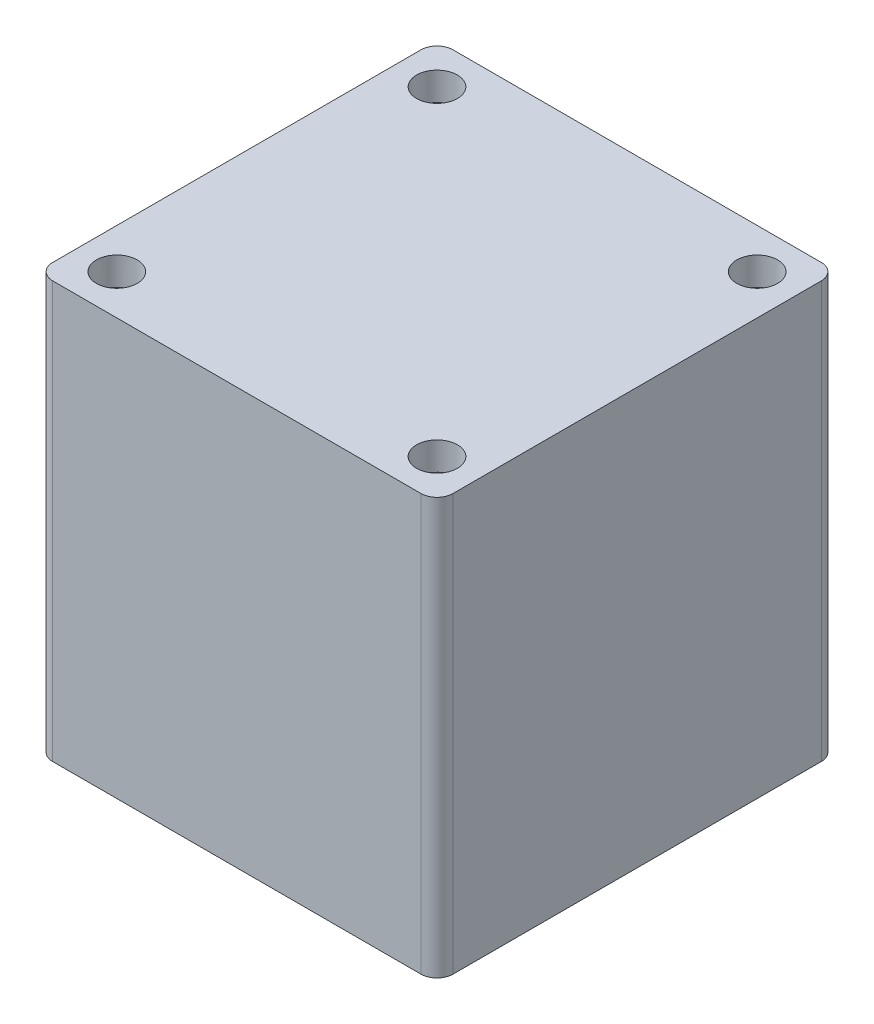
ISO-10303-21;
HEADER;
FILE_DESCRIPTION(('STEP AP214'),'2;1');
FILE_NAME('part.step','',(''),(''),'','','');
FILE_SCHEMA(('AUTOMOTIVE_DESIGN { 1 0 10303 214 1 1 1 1 }'));
ENDSEC;
DATA;
#1=APPLICATION_CONTEXT('core data for automotive mechanical design processes');
#2=APPLICATION_PROTOCOL_DEFINITION('international standard','automotive_design',2000,#1);
#3=PRODUCT_CONTEXT('',#1,'mechanical');
#4=PRODUCT('Part','Part','',(#3));
#5=PRODUCT_RELATED_PRODUCT_CATEGORY('part','',(#4));
#6=PRODUCT_DEFINITION_FORMATION('','',#4);
#7=PRODUCT_DEFINITION_CONTEXT('part definition',#1,'design');
#8=PRODUCT_DEFINITION('design','',#6,#7);
#9=PRODUCT_DEFINITION_SHAPE('','',#8);
#10=(LENGTH_UNIT() NAMED_UNIT(*) SI_UNIT(.MILLI.,.METRE.));
#11=(NAMED_UNIT(*) PLANE_ANGLE_UNIT() SI_UNIT($,.RADIAN.));
#12=(NAMED_UNIT(*) SI_UNIT($,.STERADIAN.) SOLID_ANGLE_UNIT());
#13=UNCERTAINTY_MEASURE_WITH_UNIT(LENGTH_MEASURE(1.E-05),#10,'distance_accuracy_value','');
#14=(GEOMETRIC_REPRESENTATION_CONTEXT(3) GLOBAL_UNCERTAINTY_ASSIGNED_CONTEXT((#13)) GLOBAL_UNIT_ASSIGNED_CONTEXT((#10,
#11,#12)) REPRESENTATION_CONTEXT('',''));
#15=CARTESIAN_POINT('',(0.,0.,0.));
#16=DIRECTION('',(0.,0.,1.));
#17=DIRECTION('',(1.,0.,0.));
#18=AXIS2_PLACEMENT_3D('',#15,#16,#17);
#19=CARTESIAN_POINT('',(0.,0.,0.));
#20=DIRECTION('',(0.,1.,0.));
#21=DIRECTION('',(0.,0.,1.));
#22=AXIS2_PLACEMENT_3D('',#19,#20,#21);
#23=PLANE('',#22);
#24=DIRECTION('',(0.707106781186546,0.,-0.707106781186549));
#25=VECTOR('',#24,1.);
#26=CARTESIAN_POINT('',(-8.62867965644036,0.,-8.62867965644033));
#27=LINE('',#26,#25);
#28=CARTESIAN_POINT('',(-10.1066017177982,0.,-7.1507575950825));
#29=VERTEX_POINT('',#28);
#30=CARTESIAN_POINT('',(4.74264068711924,0.,-22.));
#31=VERTEX_POINT('',#30);
#32=EDGE_CURVE('E486',#29,#31,#27,.T.);
#33=ORIENTED_EDGE('',*,*,#32,.T.);
#34=DIRECTION('',(0.70710678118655,0.,0.707106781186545));
#35=VECTOR('',#34,1.);
#36=CARTESIAN_POINT('',(13.3713203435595,0.,-13.3713203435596));
#37=LINE('',#36,#35);
#38=CARTESIAN_POINT('',(22.,0.,-4.74264068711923));
#39=VERTEX_POINT('',#38);
#40=EDGE_CURVE('E397',#31,#39,#37,.T.);
#41=ORIENTED_EDGE('',*,*,#40,.T.);
#42=DIRECTION('',(-0.707106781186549,0.,0.707106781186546));
#43=VECTOR('',#42,1.);
#44=CARTESIAN_POINT('',(8.62867965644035,0.,8.62867965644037));
#45=LINE('',#44,#43);
#46=CARTESIAN_POINT('',(-4.74264068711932,0.,22.));
#47=VERTEX_POINT('',#46);
#48=EDGE_CURVE('E417',#39,#47,#45,.T.);
#49=ORIENTED_EDGE('',*,*,#48,.T.);
#50=DIRECTION('',(1.,0.,0.));
#51=VECTOR('',#50,1.);
#52=CARTESIAN_POINT('',(22.,0.,22.));
#53=LINE('',#52,#51);
#54=CARTESIAN_POINT('',(-20.7573593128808,0.,22.));
#55=VERTEX_POINT('',#54);
#56=EDGE_CURVE('E557',#55,#47,#53,.T.);
#57=ORIENTED_EDGE('',*,*,#56,.F.);
#58=DIRECTION('',(-0.707106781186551,0.,0.707106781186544));
#59=VECTOR('',#58,1.);
#60=CARTESIAN_POINT('',(0.621320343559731,0.,0.621320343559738));
#61=LINE('',#60,#59);
#62=CARTESIAN_POINT('',(5.40559159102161,0.,-4.16295090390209));
#63=VERTEX_POINT('',#62);
#64=EDGE_CURVE('E453',#63,#55,#61,.T.);
#65=ORIENTED_EDGE('',*,*,#64,.F.);
#66=DIRECTION('',(0.707106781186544,0.,0.707106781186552));
#67=VECTOR('',#66,1.);
#68=CARTESIAN_POINT('',(4.78427124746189,0.,-4.78427124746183));
#69=LINE('',#68,#67);
#70=CARTESIAN_POINT('',(3.28427124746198,0.,-6.28427124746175));
#71=VERTEX_POINT('',#70);
#72=EDGE_CURVE('E457',#71,#63,#69,.T.);
#73=ORIENTED_EDGE('',*,*,#72,.F.);
#74=DIRECTION('',(0.707106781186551,0.,-0.707106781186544));
#75=VECTOR('',#74,1.);
#76=CARTESIAN_POINT('',(-1.4999999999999,0.,-1.49999999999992));
#77=LINE('',#76,#75);
#78=CARTESIAN_POINT('',(-25.0000000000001,0.,22.));
#79=VERTEX_POINT('',#78);
#80=EDGE_CURVE('E447',#79,#71,#77,.T.);
#81=ORIENTED_EDGE('',*,*,#80,.F.);
#82=DIRECTION('',(0.,0.,-1.));
#83=VECTOR('',#82,1.);
#84=CARTESIAN_POINT('',(-25.,0.,0.));
#85=LINE('',#84,#83);
#86=CARTESIAN_POINT('',(-25.,0.,-7.15075759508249));
#87=VERTEX_POINT('',#86);
#88=EDGE_CURVE('E586',#79,#87,#85,.T.);
#89=ORIENTED_EDGE('',*,*,#88,.T.);
#90=DIRECTION('',(-1.,0.,0.));
#91=VECTOR('',#90,1.);
#92=CARTESIAN_POINT('',(0.,0.,-7.1507575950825));
#93=LINE('',#92,#91);
#94=EDGE_CURVE('E480',#29,#87,#93,.T.);
#95=ORIENTED_EDGE('',*,*,#94,.F.);
#96=EDGE_LOOP('',(#33,#41,#49,#57,#65,#73,#81,#89,#95));
#97=FACE_BOUND('',#96,.T.);
#98=ADVANCED_FACE('F162',(#97),#23,.F.);
#99=CARTESIAN_POINT('',(22.,-42.,22.));
#100=DIRECTION('',(0.,0.,1.));
#101=DIRECTION('',(1.,0.,0.));
#102=AXIS2_PLACEMENT_3D('',#99,#100,#101);
#103=PLANE('',#102);
#104=ORIENTED_EDGE('',*,*,#56,.T.);
#105=DIRECTION('',(0.,1.,0.));
#106=VECTOR('',#105,1.);
#107=CARTESIAN_POINT('',(-4.74264068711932,-83.5270995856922,22.));
#108=LINE('',#107,#106);
#109=CARTESIAN_POINT('',(-4.74264068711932,-42.,22.));
#110=VERTEX_POINT('',#109);
#111=EDGE_CURVE('E431',#110,#47,#108,.T.);
#112=ORIENTED_EDGE('',*,*,#111,.F.);
#113=DIRECTION('',(1.,0.,0.));
#114=VECTOR('',#113,1.);
#115=CARTESIAN_POINT('',(-22.,-42.,22.));
#116=LINE('',#115,#114);
#117=CARTESIAN_POINT('',(-20.7573593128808,-42.,22.));
#118=VERTEX_POINT('',#117);
#119=EDGE_CURVE('E541',#118,#110,#116,.T.);
#120=ORIENTED_EDGE('',*,*,#119,.F.);
#121=DIRECTION('',(0.,1.,0.));
#122=VECTOR('',#121,1.);
#123=CARTESIAN_POINT('',(-20.7573593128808,-83.5270995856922,22.));
#124=LINE('',#123,#122);
#125=EDGE_CURVE('E452',#118,#55,#124,.T.);
#126=ORIENTED_EDGE('',*,*,#125,.T.);
#127=EDGE_LOOP('',(#104,#112,#120,#126));
#128=FACE_BOUND('',#127,.T.);
#129=ADVANCED_FACE('F680',(#128),#103,.F.);
#130=CARTESIAN_POINT('',(-20.,8.,20.));
#131=DIRECTION('',(0.,-1.,0.));
#132=DIRECTION('',(0.,0.,-1.));
#133=AXIS2_PLACEMENT_3D('',#130,#131,#132);
#134=CYLINDRICAL_SURFACE('',#133,2.55);
#135=CARTESIAN_POINT('',(-20.,8.,20.));
#136=DIRECTION('',(0.,1.,0.));
#137=DIRECTION('',(0.,0.,1.));
#138=AXIS2_PLACEMENT_3D('',#135,#136,#137);
#139=CIRCLE('',#138,2.55);
#140=CARTESIAN_POINT('',(-20.,8.,22.55));
#141=VERTEX_POINT('',#140);
#142=EDGE_CURVE('E594',#141,#141,#139,.T.);
#143=ORIENTED_EDGE('',*,*,#142,.T.);
#144=EDGE_LOOP('',(#143));
#145=FACE_BOUND('',#144,.T.);
#146=CARTESIAN_POINT('',(-20.,4.5,20.));
#147=DIRECTION('',(0.,-1.,0.));
#148=DIRECTION('',(0.,0.,-1.));
#149=AXIS2_PLACEMENT_3D('',#146,#147,#148);
#150=CIRCLE('',#149,2.55);
#151=CARTESIAN_POINT('',(-20.,4.5,17.45));
#152=VERTEX_POINT('',#151);
#153=EDGE_CURVE('E166',#152,#152,#150,.T.);
#154=ORIENTED_EDGE('',*,*,#153,.T.);
#155=EDGE_LOOP('',(#154));
#156=FACE_BOUND('',#155,.T.);
#157=ADVANCED_FACE('F661',(#145,#156),#134,.F.);
#158=CARTESIAN_POINT('',(-19.9999999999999,8.,-20.0000000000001));
#159=DIRECTION('',(0.,-1.,0.));
#160=DIRECTION('',(0.,0.,-1.));
#161=AXIS2_PLACEMENT_3D('',#158,#159,#160);
#162=CYLINDRICAL_SURFACE('',#161,2.55);
#163=CARTESIAN_POINT('',(-19.9999999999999,8.,-20.0000000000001));
#164=DIRECTION('',(0.,1.,0.));
#165=DIRECTION('',(0.,0.,1.));
#166=AXIS2_PLACEMENT_3D('',#163,#164,#165);
#167=CIRCLE('',#166,2.55);
#168=CARTESIAN_POINT('',(-19.9999999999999,8.,-17.4500000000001));
#169=VERTEX_POINT('',#168);
#170=EDGE_CURVE('E590',#169,#169,#167,.T.);
#171=ORIENTED_EDGE('',*,*,#170,.T.);
#172=EDGE_LOOP('',(#171));
#173=FACE_BOUND('',#172,.T.);
#174=CARTESIAN_POINT('',(-19.9999999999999,4.5,-20.0000000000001));
#175=DIRECTION('',(0.,-1.,0.));
#176=DIRECTION('',(0.,0.,-1.));
#177=AXIS2_PLACEMENT_3D('',#174,#175,#176);
#178=CIRCLE('',#177,2.55);
#179=CARTESIAN_POINT('',(-19.9999999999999,4.5,-22.5500000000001));
#180=VERTEX_POINT('',#179);
#181=EDGE_CURVE('E652',#180,#180,#178,.T.);
#182=ORIENTED_EDGE('',*,*,#181,.T.);
#183=EDGE_LOOP('',(#182));
#184=FACE_BOUND('',#183,.T.);
#185=ADVANCED_FACE('F817',(#173,#184),#162,.F.);
#186=CARTESIAN_POINT('',(20.0000000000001,8.,-19.9999999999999));
#187=DIRECTION('',(0.,-1.,0.));
#188=DIRECTION('',(0.,0.,-1.));
#189=AXIS2_PLACEMENT_3D('',#186,#187,#188);
#190=CYLINDRICAL_SURFACE('',#189,2.55);
#191=CARTESIAN_POINT('',(20.0000000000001,8.,-19.9999999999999));
#192=DIRECTION('',(0.,1.,0.));
#193=DIRECTION('',(0.,0.,1.));
#194=AXIS2_PLACEMENT_3D('',#191,#192,#193);
#195=CIRCLE('',#194,2.55);
#196=CARTESIAN_POINT('',(20.0000000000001,8.,-17.4499999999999));
#197=VERTEX_POINT('',#196);
#198=EDGE_CURVE('E585',#197,#197,#195,.T.);
#199=ORIENTED_EDGE('',*,*,#198,.T.);
#200=EDGE_LOOP('',(#199));
#201=FACE_BOUND('',#200,.T.);
#202=CARTESIAN_POINT('',(20.0000000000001,4.5,-19.9999999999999));
#203=DIRECTION('',(0.,-1.,0.));
#204=DIRECTION('',(0.,0.,-1.));
#205=AXIS2_PLACEMENT_3D('',#202,#203,#204);
#206=CIRCLE('',#205,2.55);
#207=CARTESIAN_POINT('',(20.0000000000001,4.5,-22.5499999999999));
#208=VERTEX_POINT('',#207);
#209=EDGE_CURVE('E649',#208,#208,#206,.T.);
#210=ORIENTED_EDGE('',*,*,#209,.T.);
#211=EDGE_LOOP('',(#210));
#212=FACE_BOUND('',#211,.T.);
#213=ADVANCED_FACE('F815',(#201,#212),#190,.F.);
#214=CARTESIAN_POINT('',(19.9999999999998,8.,20.0000000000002));
#215=DIRECTION('',(0.,-1.,0.));
#216=DIRECTION('',(0.,0.,-1.));
#217=AXIS2_PLACEMENT_3D('',#214,#215,#216);
#218=CYLINDRICAL_SURFACE('',#217,2.55);
#219=CARTESIAN_POINT('',(19.9999999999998,8.,20.0000000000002));
#220=DIRECTION('',(0.,1.,0.));
#221=DIRECTION('',(0.,0.,1.));
#222=AXIS2_PLACEMENT_3D('',#219,#220,#221);
#223=CIRCLE('',#222,2.55);
#224=CARTESIAN_POINT('',(19.9999999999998,8.,22.5500000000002));
#225=VERTEX_POINT('',#224);
#226=EDGE_CURVE('E581',#225,#225,#223,.T.);
#227=ORIENTED_EDGE('',*,*,#226,.T.);
#228=EDGE_LOOP('',(#227));
#229=FACE_BOUND('',#228,.T.);
#230=CARTESIAN_POINT('',(19.9999999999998,4.5,20.0000000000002));
#231=DIRECTION('',(0.,-1.,0.));
#232=DIRECTION('',(0.,0.,-1.));
#233=AXIS2_PLACEMENT_3D('',#230,#231,#232);
#234=CIRCLE('',#233,2.55);
#235=CARTESIAN_POINT('',(19.9999999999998,4.5,17.4500000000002));
#236=VERTEX_POINT('',#235);
#237=EDGE_CURVE('E580',#236,#236,#234,.T.);
#238=ORIENTED_EDGE('',*,*,#237,.T.);
#239=EDGE_LOOP('',(#238));
#240=FACE_BOUND('',#239,.T.);
#241=ADVANCED_FACE('F164',(#229,#240),#218,.F.);
#242=CARTESIAN_POINT('',(0.,8.,-25.));
#243=DIRECTION('',(0.,0.,1.));
#244=DIRECTION('',(1.,0.,0.));
#245=AXIS2_PLACEMENT_3D('',#242,#243,#244);
#246=PLANE('',#245);
#247=DIRECTION('',(0.,-1.,0.));
#248=VECTOR('',#247,1.);
#249=CARTESIAN_POINT('',(23.,8.,-25.));
#250=LINE('',#249,#248);
#251=CARTESIAN_POINT('',(23.,8.,-25.));
#252=VERTEX_POINT('',#251);
#253=CARTESIAN_POINT('',(23.,-44.,-25.));
#254=VERTEX_POINT('',#253);
#255=EDGE_CURVE('E358',#252,#254,#250,.T.);
#256=ORIENTED_EDGE('',*,*,#255,.T.);
#257=DIRECTION('',(1.,0.,0.));
#258=VECTOR('',#257,1.);
#259=CARTESIAN_POINT('',(-23.,-44.,-25.));
#260=LINE('',#259,#258);
#261=CARTESIAN_POINT('',(-23.,-44.,-25.));
#262=VERTEX_POINT('',#261);
#263=EDGE_CURVE('E355',#262,#254,#260,.T.);
#264=ORIENTED_EDGE('',*,*,#263,.F.);
#265=DIRECTION('',(0.,-1.,0.));
#266=VECTOR('',#265,1.);
#267=CARTESIAN_POINT('',(-23.,8.,-25.));
#268=LINE('',#267,#266);
#269=CARTESIAN_POINT('',(-23.,8.,-25.));
#270=VERTEX_POINT('',#269);
#271=EDGE_CURVE('E12',#270,#262,#268,.T.);
#272=ORIENTED_EDGE('',*,*,#271,.F.);
#273=DIRECTION('',(-1.,0.,0.));
#274=VECTOR('',#273,1.);
#275=CARTESIAN_POINT('',(0.,8.,-25.));
#276=LINE('',#275,#274);
#277=EDGE_CURVE('E598',#252,#270,#276,.T.);
#278=ORIENTED_EDGE('',*,*,#277,.F.);
#279=EDGE_LOOP('',(#256,#264,#272,#278));
#280=FACE_BOUND('',#279,.T.);
#281=ADVANCED_FACE('F356',(#280),#246,.F.);
#282=CARTESIAN_POINT('',(-23.,8.,-23.));
#283=DIRECTION('',(0.,-1.,0.));
#284=DIRECTION('',(0.,0.,-1.));
#285=AXIS2_PLACEMENT_3D('',#282,#283,#284);
#286=CYLINDRICAL_SURFACE('',#285,2.);
#287=ORIENTED_EDGE('',*,*,#271,.T.);
#288=CARTESIAN_POINT('',(-23.,-44.,-23.));
#289=DIRECTION('',(0.,-1.,0.));
#290=DIRECTION('',(0.,0.,-1.));
#291=AXIS2_PLACEMENT_3D('',#288,#289,#290);
#292=CIRCLE('',#291,2.);
#293=CARTESIAN_POINT('',(-25.,-44.,-23.));
#294=VERTEX_POINT('',#293);
#295=EDGE_CURVE('E349',#294,#262,#292,.T.);
#296=ORIENTED_EDGE('',*,*,#295,.F.);
#297=DIRECTION('',(0.,-1.,0.));
#298=VECTOR('',#297,1.);
#299=CARTESIAN_POINT('',(-25.,8.,-23.));
#300=LINE('',#299,#298);
#301=CARTESIAN_POINT('',(-25.,8.,-23.));
#302=VERTEX_POINT('',#301);
#303=EDGE_CURVE('E173',#302,#294,#300,.T.);
#304=ORIENTED_EDGE('',*,*,#303,.F.);
#305=CARTESIAN_POINT('',(-23.,8.,-23.));
#306=DIRECTION('',(0.,1.,0.));
#307=DIRECTION('',(0.,0.,1.));
#308=AXIS2_PLACEMENT_3D('',#305,#306,#307);
#309=CIRCLE('',#308,2.);
#310=EDGE_CURVE('E350',#270,#302,#309,.T.);
#311=ORIENTED_EDGE('',*,*,#310,.F.);
#312=EDGE_LOOP('',(#287,#296,#304,#311));
#313=FACE_BOUND('',#312,.T.);
#314=ADVANCED_FACE('F346',(#313),#286,.T.);
#315=CARTESIAN_POINT('',(-25.,8.,0.));
#316=DIRECTION('',(-1.,0.,0.));
#317=DIRECTION('',(0.,0.,1.));
#318=AXIS2_PLACEMENT_3D('',#315,#316,#317);
#319=PLANE('',#318);
#320=ORIENTED_EDGE('',*,*,#303,.T.);
#321=DIRECTION('',(0.,0.,-1.));
#322=VECTOR('',#321,1.);
#323=CARTESIAN_POINT('',(-25.,-44.,23.));
#324=LINE('',#323,#322);
#325=CARTESIAN_POINT('',(-25.,-44.,23.));
#326=VERTEX_POINT('',#325);
#327=EDGE_CURVE('E369',#326,#294,#324,.T.);
#328=ORIENTED_EDGE('',*,*,#327,.F.);
#329=DIRECTION('',(0.,-1.,0.));
#330=VECTOR('',#329,1.);
#331=CARTESIAN_POINT('',(-25.,8.,23.));
#332=LINE('',#331,#330);
#333=CARTESIAN_POINT('',(-25.,8.,23.));
#334=VERTEX_POINT('',#333);
#335=EDGE_CURVE('E641',#334,#326,#332,.T.);
#336=ORIENTED_EDGE('',*,*,#335,.F.);
#337=DIRECTION('',(0.,0.,-1.));
#338=VECTOR('',#337,1.);
#339=CARTESIAN_POINT('',(-25.,8.,0.));
#340=LINE('',#339,#338);
#341=EDGE_CURVE('E603',#334,#302,#340,.T.);
#342=ORIENTED_EDGE('',*,*,#341,.T.);
#343=EDGE_LOOP('',(#320,#328,#336,#342));
#344=FACE_BOUND('',#343,.T.);
#345=ORIENTED_EDGE('',*,*,#88,.F.);
#346=DIRECTION('',(0.,1.,0.));
#347=VECTOR('',#346,1.);
#348=CARTESIAN_POINT('',(-25.,-42.,22.));
#349=LINE('',#348,#347);
#350=CARTESIAN_POINT('',(-25.0000000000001,-42.,22.));
#351=VERTEX_POINT('',#350);
#352=EDGE_CURVE('E577',#351,#79,#349,.T.);
#353=ORIENTED_EDGE('',*,*,#352,.F.);
#354=DIRECTION('',(0.,0.,-1.));
#355=VECTOR('',#354,1.);
#356=CARTESIAN_POINT('',(-25.,-42.,23.));
#357=LINE('',#356,#355);
#358=CARTESIAN_POINT('',(-25.,-42.,-7.15075759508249));
#359=VERTEX_POINT('',#358);
#360=EDGE_CURVE('E371',#351,#359,#357,.T.);
#361=ORIENTED_EDGE('',*,*,#360,.T.);
#362=DIRECTION('',(0.,1.,0.));
#363=VECTOR('',#362,1.);
#364=CARTESIAN_POINT('',(-25.,-83.5270995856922,-7.15075759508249));
#365=LINE('',#364,#363);
#366=EDGE_CURVE('E484',#359,#87,#365,.T.);
#367=ORIENTED_EDGE('',*,*,#366,.T.);
#368=EDGE_LOOP('',(#345,#353,#361,#367));
#369=FACE_BOUND('',#368,.T.);
#370=ADVANCED_FACE('F757',(#344,#369),#319,.T.);
#371=CARTESIAN_POINT('',(-23.,8.,23.));
#372=DIRECTION('',(0.,-1.,0.));
#373=DIRECTION('',(0.,0.,-1.));
#374=AXIS2_PLACEMENT_3D('',#371,#372,#373);
#375=CYLINDRICAL_SURFACE('',#374,2.);
#376=ORIENTED_EDGE('',*,*,#335,.T.);
#377=CARTESIAN_POINT('',(-23.,-44.,23.));
#378=DIRECTION('',(0.,-1.,0.));
#379=DIRECTION('',(0.,0.,-1.));
#380=AXIS2_PLACEMENT_3D('',#377,#378,#379);
#381=CIRCLE('',#380,2.);
#382=CARTESIAN_POINT('',(-23.,-44.,25.));
#383=VERTEX_POINT('',#382);
#384=EDGE_CURVE('E391',#383,#326,#381,.T.);
#385=ORIENTED_EDGE('',*,*,#384,.F.);
#386=DIRECTION('',(0.,-1.,0.));
#387=VECTOR('',#386,1.);
#388=CARTESIAN_POINT('',(-23.,8.,25.));
#389=LINE('',#388,#387);
#390=CARTESIAN_POINT('',(-23.,8.,25.));
#391=VERTEX_POINT('',#390);
#392=EDGE_CURVE('E638',#391,#383,#389,.T.);
#393=ORIENTED_EDGE('',*,*,#392,.F.);
#394=CARTESIAN_POINT('',(-23.,8.,23.));
#395=DIRECTION('',(0.,1.,0.));
#396=DIRECTION('',(0.,0.,1.));
#397=AXIS2_PLACEMENT_3D('',#394,#395,#396);
#398=CIRCLE('',#397,2.);
#399=EDGE_CURVE('E607',#391,#334,#398,.F.);
#400=ORIENTED_EDGE('',*,*,#399,.T.);
#401=EDGE_LOOP('',(#376,#385,#393,#400));
#402=FACE_BOUND('',#401,.T.);
#403=ADVANCED_FACE('F836',(#402),#375,.T.);
#404=CARTESIAN_POINT('',(0.,8.,25.));
#405=DIRECTION('',(0.,0.,1.));
#406=DIRECTION('',(1.,0.,0.));
#407=AXIS2_PLACEMENT_3D('',#404,#405,#406);
#408=PLANE('',#407);
#409=ORIENTED_EDGE('',*,*,#392,.T.);
#410=DIRECTION('',(-1.,0.,0.));
#411=VECTOR('',#410,1.);
#412=CARTESIAN_POINT('',(23.,-44.,25.));
#413=LINE('',#412,#411);
#414=CARTESIAN_POINT('',(23.,-44.,25.));
#415=VERTEX_POINT('',#414);
#416=EDGE_CURVE('E387',#415,#383,#413,.T.);
#417=ORIENTED_EDGE('',*,*,#416,.F.);
#418=DIRECTION('',(0.,-1.,0.));
#419=VECTOR('',#418,1.);
#420=CARTESIAN_POINT('',(23.,8.,25.));
#421=LINE('',#420,#419);
#422=CARTESIAN_POINT('',(23.,8.,25.));
#423=VERTEX_POINT('',#422);
#424=EDGE_CURVE('E635',#423,#415,#421,.T.);
#425=ORIENTED_EDGE('',*,*,#424,.F.);
#426=DIRECTION('',(-1.,0.,0.));
#427=VECTOR('',#426,1.);
#428=CARTESIAN_POINT('',(0.,8.,25.));
#429=LINE('',#428,#427);
#430=EDGE_CURVE('E611',#423,#391,#429,.T.);
#431=ORIENTED_EDGE('',*,*,#430,.T.);
#432=EDGE_LOOP('',(#409,#417,#425,#431));
#433=FACE_BOUND('',#432,.T.);
#434=ADVANCED_FACE('F840',(#433),#408,.T.);
#435=CARTESIAN_POINT('',(23.,8.,23.));
#436=DIRECTION('',(0.,-1.,0.));
#437=DIRECTION('',(0.,0.,-1.));
#438=AXIS2_PLACEMENT_3D('',#435,#436,#437);
#439=CYLINDRICAL_SURFACE('',#438,2.);
#440=ORIENTED_EDGE('',*,*,#424,.T.);
#441=CARTESIAN_POINT('',(23.,-44.,23.));
#442=DIRECTION('',(0.,-1.,0.));
#443=DIRECTION('',(0.,0.,-1.));
#444=AXIS2_PLACEMENT_3D('',#441,#442,#443);
#445=CIRCLE('',#444,2.);
#446=CARTESIAN_POINT('',(25.,-44.,23.));
#447=VERTEX_POINT('',#446);
#448=EDGE_CURVE('E383',#447,#415,#445,.T.);
#449=ORIENTED_EDGE('',*,*,#448,.F.);
#450=DIRECTION('',(0.,-1.,0.));
#451=VECTOR('',#450,1.);
#452=CARTESIAN_POINT('',(25.,8.,23.));
#453=LINE('',#452,#451);
#454=CARTESIAN_POINT('',(25.,8.,23.));
#455=VERTEX_POINT('',#454);
#456=EDGE_CURVE('E632',#455,#447,#453,.T.);
#457=ORIENTED_EDGE('',*,*,#456,.F.);
#458=CARTESIAN_POINT('',(23.,8.,23.));
#459=DIRECTION('',(0.,1.,0.));
#460=DIRECTION('',(0.,0.,1.));
#461=AXIS2_PLACEMENT_3D('',#458,#459,#460);
#462=CIRCLE('',#461,2.);
#463=EDGE_CURVE('E615',#423,#455,#462,.T.);
#464=ORIENTED_EDGE('',*,*,#463,.F.);
#465=EDGE_LOOP('',(#440,#449,#457,#464));
#466=FACE_BOUND('',#465,.T.);
#467=ADVANCED_FACE('F844',(#466),#439,.T.);
#468=CARTESIAN_POINT('',(25.,8.,0.));
#469=DIRECTION('',(-1.,0.,0.));
#470=DIRECTION('',(0.,0.,1.));
#471=AXIS2_PLACEMENT_3D('',#468,#469,#470);
#472=PLANE('',#471);
#473=ORIENTED_EDGE('',*,*,#456,.T.);
#474=DIRECTION('',(0.,0.,1.));
#475=VECTOR('',#474,1.);
#476=CARTESIAN_POINT('',(25.,-44.,-23.));
#477=LINE('',#476,#475);
#478=CARTESIAN_POINT('',(25.,-44.,-23.));
#479=VERTEX_POINT('',#478);
#480=EDGE_CURVE('E379',#479,#447,#477,.T.);
#481=ORIENTED_EDGE('',*,*,#480,.F.);
#482=DIRECTION('',(0.,-1.,0.));
#483=VECTOR('',#482,1.);
#484=CARTESIAN_POINT('',(25.,8.,-23.));
#485=LINE('',#484,#483);
#486=CARTESIAN_POINT('',(25.,8.,-23.));
#487=VERTEX_POINT('',#486);
#488=EDGE_CURVE('E629',#487,#479,#485,.T.);
#489=ORIENTED_EDGE('',*,*,#488,.F.);
#490=DIRECTION('',(0.,0.,-1.));
#491=VECTOR('',#490,1.);
#492=CARTESIAN_POINT('',(25.,8.,0.));
#493=LINE('',#492,#491);
#494=EDGE_CURVE('E618',#455,#487,#493,.T.);
#495=ORIENTED_EDGE('',*,*,#494,.F.);
#496=EDGE_LOOP('',(#473,#481,#489,#495));
#497=FACE_BOUND('',#496,.T.);
#498=ADVANCED_FACE('F848',(#497),#472,.F.);
#499=CARTESIAN_POINT('',(23.,8.,-23.));
#500=DIRECTION('',(0.,-1.,0.));
#501=DIRECTION('',(0.,0.,-1.));
#502=AXIS2_PLACEMENT_3D('',#499,#500,#501);
#503=CYLINDRICAL_SURFACE('',#502,2.);
#504=ORIENTED_EDGE('',*,*,#488,.T.);
#505=CARTESIAN_POINT('',(23.,-44.,-23.));
#506=DIRECTION('',(0.,-1.,0.));
#507=DIRECTION('',(0.,0.,-1.));
#508=AXIS2_PLACEMENT_3D('',#505,#506,#507);
#509=CIRCLE('',#508,2.);
#510=EDGE_CURVE('E363',#254,#479,#509,.T.);
#511=ORIENTED_EDGE('',*,*,#510,.F.);
#512=ORIENTED_EDGE('',*,*,#255,.F.);
#513=CARTESIAN_POINT('',(23.,8.,-23.));
#514=DIRECTION('',(0.,1.,0.));
#515=DIRECTION('',(0.,0.,1.));
#516=AXIS2_PLACEMENT_3D('',#513,#514,#515);
#517=CIRCLE('',#516,2.);
#518=EDGE_CURVE('E621',#487,#252,#517,.T.);
#519=ORIENTED_EDGE('',*,*,#518,.F.);
#520=EDGE_LOOP('',(#504,#511,#512,#519));
#521=FACE_BOUND('',#520,.T.);
#522=ADVANCED_FACE('F851',(#521),#503,.T.);
#523=CARTESIAN_POINT('',(0.,8.,0.));
#524=DIRECTION('',(0.,1.,0.));
#525=DIRECTION('',(0.,0.,1.));
#526=AXIS2_PLACEMENT_3D('',#523,#524,#525);
#527=PLANE('',#526);
#528=ORIENTED_EDGE('',*,*,#226,.F.);
#529=EDGE_LOOP('',(#528));
#530=FACE_BOUND('',#529,.T.);
#531=ORIENTED_EDGE('',*,*,#198,.F.);
#532=EDGE_LOOP('',(#531));
#533=FACE_BOUND('',#532,.T.);
#534=ORIENTED_EDGE('',*,*,#170,.F.);
#535=EDGE_LOOP('',(#534));
#536=FACE_BOUND('',#535,.T.);
#537=ORIENTED_EDGE('',*,*,#142,.F.);
#538=EDGE_LOOP('',(#537));
#539=FACE_BOUND('',#538,.T.);
#540=ORIENTED_EDGE('',*,*,#277,.T.);
#541=ORIENTED_EDGE('',*,*,#310,.T.);
#542=ORIENTED_EDGE('',*,*,#341,.F.);
#543=ORIENTED_EDGE('',*,*,#399,.F.);
#544=ORIENTED_EDGE('',*,*,#430,.F.);
#545=ORIENTED_EDGE('',*,*,#463,.T.);
#546=ORIENTED_EDGE('',*,*,#494,.T.);
#547=ORIENTED_EDGE('',*,*,#518,.T.);
#548=EDGE_LOOP('',(#540,#541,#542,#543,#544,#545,#546,#547));
#549=FACE_BOUND('',#548,.T.);
#550=ADVANCED_FACE('F807',(#530,#533,#536,#539,#549),#527,.T.);
#551=CARTESIAN_POINT('',(19.9999999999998,4.5,20.0000000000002));
#552=DIRECTION('',(0.,-1.,0.));
#553=DIRECTION('',(0.,0.,-1.));
#554=AXIS2_PLACEMENT_3D('',#551,#552,#553);
#555=PLANE('',#554);
#556=ORIENTED_EDGE('',*,*,#237,.F.);
#557=EDGE_LOOP('',(#556));
#558=FACE_BOUND('',#557,.T.);
#559=ADVANCED_FACE('F804',(#558),#555,.F.);
#560=CARTESIAN_POINT('',(20.0000000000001,4.5,-19.9999999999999));
#561=DIRECTION('',(0.,-1.,0.));
#562=DIRECTION('',(0.,0.,-1.));
#563=AXIS2_PLACEMENT_3D('',#560,#561,#562);
#564=PLANE('',#563);
#565=ORIENTED_EDGE('',*,*,#209,.F.);
#566=EDGE_LOOP('',(#565));
#567=FACE_BOUND('',#566,.T.);
#568=ADVANCED_FACE('F675',(#567),#564,.F.);
#569=CARTESIAN_POINT('',(-19.9999999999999,4.5,-20.0000000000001));
#570=DIRECTION('',(0.,-1.,0.));
#571=DIRECTION('',(0.,0.,-1.));
#572=AXIS2_PLACEMENT_3D('',#569,#570,#571);
#573=PLANE('',#572);
#574=ORIENTED_EDGE('',*,*,#181,.F.);
#575=EDGE_LOOP('',(#574));
#576=FACE_BOUND('',#575,.T.);
#577=ADVANCED_FACE('F666',(#576),#573,.F.);
#578=CARTESIAN_POINT('',(-20.,4.5,20.));
#579=DIRECTION('',(0.,-1.,0.));
#580=DIRECTION('',(0.,0.,-1.));
#581=AXIS2_PLACEMENT_3D('',#578,#579,#580);
#582=PLANE('',#581);
#583=ORIENTED_EDGE('',*,*,#153,.F.);
#584=EDGE_LOOP('',(#583));
#585=FACE_BOUND('',#584,.T.);
#586=ADVANCED_FACE('F663',(#585),#582,.F.);
#587=CARTESIAN_POINT('',(-8.62867965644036,-83.5270995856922,-8.62867965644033));
#588=DIRECTION('',(0.707106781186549,0.,0.707106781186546));
#589=DIRECTION('',(0.707106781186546,0.,-0.707106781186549));
#590=AXIS2_PLACEMENT_3D('',#587,#588,#589);
#591=PLANE('',#590);
#592=DIRECTION('',(0.,1.,0.));
#593=VECTOR('',#592,1.);
#594=CARTESIAN_POINT('',(-10.1066017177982,-83.5270995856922,-7.1507575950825));
#595=LINE('',#594,#593);
#596=CARTESIAN_POINT('',(-10.1066017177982,-42.,-7.1507575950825));
#597=VERTEX_POINT('',#596);
#598=EDGE_CURVE('E485',#597,#29,#595,.T.);
#599=ORIENTED_EDGE('',*,*,#598,.F.);
#600=DIRECTION('',(0.707106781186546,0.,-0.707106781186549));
#601=VECTOR('',#600,1.);
#602=CARTESIAN_POINT('',(-8.62867965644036,-42.,-8.62867965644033));
#603=LINE('',#602,#601);
#604=CARTESIAN_POINT('',(4.74264068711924,-42.,-22.));
#605=VERTEX_POINT('',#604);
#606=EDGE_CURVE('E511',#597,#605,#603,.T.);
#607=ORIENTED_EDGE('',*,*,#606,.T.);
#608=DIRECTION('',(0.,1.,0.));
#609=VECTOR('',#608,1.);
#610=CARTESIAN_POINT('',(4.74264068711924,-83.5270995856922,-22.));
#611=LINE('',#610,#609);
#612=EDGE_CURVE('E514',#605,#31,#611,.T.);
#613=ORIENTED_EDGE('',*,*,#612,.T.);
#614=ORIENTED_EDGE('',*,*,#32,.F.);
#615=EDGE_LOOP('',(#599,#607,#613,#614));
#616=FACE_BOUND('',#615,.T.);
#617=ADVANCED_FACE('F665',(#616),#591,.T.);
#618=CARTESIAN_POINT('',(0.,-83.5270995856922,-7.1507575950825));
#619=DIRECTION('',(0.,0.,-1.));
#620=DIRECTION('',(-1.,0.,0.));
#621=AXIS2_PLACEMENT_3D('',#618,#619,#620);
#622=PLANE('',#621);
#623=DIRECTION('',(-1.,0.,0.));
#624=VECTOR('',#623,1.);
#625=CARTESIAN_POINT('',(0.,-42.,-7.1507575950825));
#626=LINE('',#625,#624);
#627=EDGE_CURVE('E505',#597,#359,#626,.T.);
#628=ORIENTED_EDGE('',*,*,#627,.F.);
#629=ORIENTED_EDGE('',*,*,#598,.T.);
#630=ORIENTED_EDGE('',*,*,#94,.T.);
#631=ORIENTED_EDGE('',*,*,#366,.F.);
#632=EDGE_LOOP('',(#628,#629,#630,#631));
#633=FACE_BOUND('',#632,.T.);
#634=ADVANCED_FACE('F672',(#633),#622,.F.);
#635=CARTESIAN_POINT('',(4.78427124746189,-83.5270995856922,-4.78427124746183));
#636=DIRECTION('',(-0.707106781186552,0.,0.707106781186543));
#637=DIRECTION('',(0.707106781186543,0.,0.707106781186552));
#638=AXIS2_PLACEMENT_3D('',#635,#636,#637);
#639=PLANE('',#638);
#640=DIRECTION('',(0.707106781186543,0.,0.707106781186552));
#641=VECTOR('',#640,1.);
#642=CARTESIAN_POINT('',(4.78427124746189,-42.,-4.78427124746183));
#643=LINE('',#642,#641);
#644=CARTESIAN_POINT('',(3.28427124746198,-42.,-6.28427124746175));
#645=VERTEX_POINT('',#644);
#646=CARTESIAN_POINT('',(5.40559159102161,-42.,-4.16295090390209));
#647=VERTEX_POINT('',#646);
#648=EDGE_CURVE('E466',#645,#647,#643,.T.);
#649=ORIENTED_EDGE('',*,*,#648,.F.);
#650=DIRECTION('',(0.,1.,0.));
#651=VECTOR('',#650,1.);
#652=CARTESIAN_POINT('',(3.28427124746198,-83.5270995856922,-6.28427124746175));
#653=LINE('',#652,#651);
#654=EDGE_CURVE('E421',#645,#71,#653,.T.);
#655=ORIENTED_EDGE('',*,*,#654,.T.);
#656=ORIENTED_EDGE('',*,*,#72,.T.);
#657=DIRECTION('',(0.,1.,0.));
#658=VECTOR('',#657,1.);
#659=CARTESIAN_POINT('',(5.40559159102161,-83.5270995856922,-4.16295090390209));
#660=LINE('',#659,#658);
#661=EDGE_CURVE('E456',#647,#63,#660,.T.);
#662=ORIENTED_EDGE('',*,*,#661,.F.);
#663=EDGE_LOOP('',(#649,#655,#656,#662));
#664=FACE_BOUND('',#663,.T.);
#665=ADVANCED_FACE('F765',(#664),#639,.F.);
#666=CARTESIAN_POINT('',(0.621320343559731,-83.5270995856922,0.621320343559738));
#667=DIRECTION('',(-0.707106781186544,0.,-0.707106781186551));
#668=DIRECTION('',(-0.707106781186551,0.,0.707106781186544));
#669=AXIS2_PLACEMENT_3D('',#666,#667,#668);
#670=PLANE('',#669);
#671=DIRECTION('',(-0.707106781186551,0.,0.707106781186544));
#672=VECTOR('',#671,1.);
#673=CARTESIAN_POINT('',(0.621320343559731,-42.,0.621320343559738));
#674=LINE('',#673,#672);
#675=EDGE_CURVE('E461',#647,#118,#674,.T.);
#676=ORIENTED_EDGE('',*,*,#675,.F.);
#677=ORIENTED_EDGE('',*,*,#661,.T.);
#678=ORIENTED_EDGE('',*,*,#64,.T.);
#679=ORIENTED_EDGE('',*,*,#125,.F.);
#680=EDGE_LOOP('',(#676,#677,#678,#679));
#681=FACE_BOUND('',#680,.T.);
#682=ADVANCED_FACE('F768',(#681),#670,.F.);
#683=CARTESIAN_POINT('',(-1.4999999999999,-83.5270995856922,-1.49999999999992));
#684=DIRECTION('',(0.707106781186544,0.,0.707106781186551));
#685=DIRECTION('',(0.707106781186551,0.,-0.707106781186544));
#686=AXIS2_PLACEMENT_3D('',#683,#684,#685);
#687=PLANE('',#686);
#688=DIRECTION('',(0.707106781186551,0.,-0.707106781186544));
#689=VECTOR('',#688,1.);
#690=CARTESIAN_POINT('',(-1.4999999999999,-42.,-1.49999999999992));
#691=LINE('',#690,#689);
#692=EDGE_CURVE('E451',#351,#645,#691,.T.);
#693=ORIENTED_EDGE('',*,*,#692,.F.);
#694=ORIENTED_EDGE('',*,*,#352,.T.);
#695=ORIENTED_EDGE('',*,*,#80,.T.);
#696=ORIENTED_EDGE('',*,*,#654,.F.);
#697=EDGE_LOOP('',(#693,#694,#695,#696));
#698=FACE_BOUND('',#697,.T.);
#699=ADVANCED_FACE('F761',(#698),#687,.F.);
#700=CARTESIAN_POINT('',(8.62867965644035,-83.5270995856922,8.62867965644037));
#701=DIRECTION('',(-0.707106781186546,0.,-0.707106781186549));
#702=DIRECTION('',(-0.707106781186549,0.,0.707106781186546));
#703=AXIS2_PLACEMENT_3D('',#700,#701,#702);
#704=PLANE('',#703);
#705=DIRECTION('',(0.,1.,0.));
#706=VECTOR('',#705,1.);
#707=CARTESIAN_POINT('',(22.,-83.5270995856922,-4.74264068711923));
#708=LINE('',#707,#706);
#709=CARTESIAN_POINT('',(22.,-42.,-4.74264068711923));
#710=VERTEX_POINT('',#709);
#711=EDGE_CURVE('E426',#710,#39,#708,.T.);
#712=ORIENTED_EDGE('',*,*,#711,.F.);
#713=DIRECTION('',(-0.707106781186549,0.,0.707106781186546));
#714=VECTOR('',#713,1.);
#715=CARTESIAN_POINT('',(8.62867965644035,-42.,8.62867965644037));
#716=LINE('',#715,#714);
#717=EDGE_CURVE('E427',#710,#110,#716,.T.);
#718=ORIENTED_EDGE('',*,*,#717,.T.);
#719=ORIENTED_EDGE('',*,*,#111,.T.);
#720=ORIENTED_EDGE('',*,*,#48,.F.);
#721=EDGE_LOOP('',(#712,#718,#719,#720));
#722=FACE_BOUND('',#721,.T.);
#723=ADVANCED_FACE('F741',(#722),#704,.T.);
#724=CARTESIAN_POINT('',(13.3713203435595,-83.5270995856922,-13.3713203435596));
#725=DIRECTION('',(-0.707106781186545,0.,0.70710678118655));
#726=DIRECTION('',(0.70710678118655,0.,0.707106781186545));
#727=AXIS2_PLACEMENT_3D('',#724,#725,#726);
#728=PLANE('',#727);
#729=ORIENTED_EDGE('',*,*,#612,.F.);
#730=DIRECTION('',(0.70710678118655,0.,0.707106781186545));
#731=VECTOR('',#730,1.);
#732=CARTESIAN_POINT('',(13.3713203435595,-42.,-13.3713203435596));
#733=LINE('',#732,#731);
#734=EDGE_CURVE('E402',#605,#710,#733,.T.);
#735=ORIENTED_EDGE('',*,*,#734,.T.);
#736=ORIENTED_EDGE('',*,*,#711,.T.);
#737=ORIENTED_EDGE('',*,*,#40,.F.);
#738=EDGE_LOOP('',(#729,#735,#736,#737));
#739=FACE_BOUND('',#738,.T.);
#740=ADVANCED_FACE('F736',(#739),#728,.T.);
#741=CARTESIAN_POINT('',(-23.,-42.,-23.));
#742=DIRECTION('',(0.,-1.,0.));
#743=DIRECTION('',(0.,0.,-1.));
#744=AXIS2_PLACEMENT_3D('',#741,#742,#743);
#745=PLANE('',#744);
#746=ORIENTED_EDGE('',*,*,#606,.F.);
#747=ORIENTED_EDGE('',*,*,#627,.T.);
#748=ORIENTED_EDGE('',*,*,#360,.F.);
#749=ORIENTED_EDGE('',*,*,#692,.T.);
#750=ORIENTED_EDGE('',*,*,#648,.T.);
#751=ORIENTED_EDGE('',*,*,#675,.T.);
#752=ORIENTED_EDGE('',*,*,#119,.T.);
#753=ORIENTED_EDGE('',*,*,#717,.F.);
#754=ORIENTED_EDGE('',*,*,#734,.F.);
#755=EDGE_LOOP('',(#746,#747,#748,#749,#750,#751,#752,#753,#754));
#756=FACE_BOUND('',#755,.T.);
#757=ADVANCED_FACE('F712',(#756),#745,.F.);
#758=CARTESIAN_POINT('',(-23.,-44.,-23.));
#759=DIRECTION('',(0.,-1.,0.));
#760=DIRECTION('',(0.,0.,-1.));
#761=AXIS2_PLACEMENT_3D('',#758,#759,#760);
#762=PLANE('',#761);
#763=ORIENTED_EDGE('',*,*,#295,.T.);
#764=ORIENTED_EDGE('',*,*,#263,.T.);
#765=ORIENTED_EDGE('',*,*,#510,.T.);
#766=ORIENTED_EDGE('',*,*,#480,.T.);
#767=ORIENTED_EDGE('',*,*,#448,.T.);
#768=ORIENTED_EDGE('',*,*,#416,.T.);
#769=ORIENTED_EDGE('',*,*,#384,.T.);
#770=ORIENTED_EDGE('',*,*,#327,.T.);
#771=EDGE_LOOP('',(#763,#764,#765,#766,#767,#768,#769,#770));
#772=FACE_BOUND('',#771,.T.);
#773=ADVANCED_FACE('F366',(#772),#762,.T.);
#774=CLOSED_SHELL('',(#98,#129,#157,#185,#213,#241,#281,#314,#370,#403,#434,#467,#498,#522,#550,
#559,#568,#577,#586,#617,#634,#665,#682,#699,#723,#740,#757,#773));
#775=DIRECTION('',(-1.,0.,0.));
#776=VECTOR('',#775,1.);
#777=CARTESIAN_POINT('',(-22.,-42.,-22.));
#778=LINE('',#777,#776);
#779=CARTESIAN_POINT('',(22.,-42.,-22.));
#780=VERTEX_POINT('',#779);
#781=CARTESIAN_POINT('',(8.98528137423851,-42.,-22.));
#782=VERTEX_POINT('',#781);
#783=EDGE_CURVE('E552',#780,#782,#778,.T.);
#784=ORIENTED_EDGE('',*,*,#783,.T.);
#785=DIRECTION('',(0.707106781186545,0.,0.70710678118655));
#786=VECTOR('',#785,1.);
#787=CARTESIAN_POINT('',(15.4926406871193,-42.,-15.4926406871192));
#788=LINE('',#787,#786);
#789=CARTESIAN_POINT('',(22.,-42.,-8.98528137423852));
#790=VERTEX_POINT('',#789);
#791=EDGE_CURVE('E401',#782,#790,#788,.T.);
#792=ORIENTED_EDGE('',*,*,#791,.T.);
#793=DIRECTION('',(0.,0.,-1.));
#794=VECTOR('',#793,1.);
#795=CARTESIAN_POINT('',(22.,-42.,-22.));
#796=LINE('',#795,#794);
#797=EDGE_CURVE('E545',#790,#780,#796,.T.);
#798=ORIENTED_EDGE('',*,*,#797,.T.);
#799=EDGE_LOOP('',(#784,#792,#798));
#800=FACE_BOUND('',#799,.T.);
#801=ADVANCED_FACE('F694',(#800),#745,.F.);
#802=DIRECTION('',(0.707106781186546,0.,0.70710678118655));
#803=VECTOR('',#802,1.);
#804=CARTESIAN_POINT('',(15.4926406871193,0.,-15.4926406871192));
#805=LINE('',#804,#803);
#806=CARTESIAN_POINT('',(8.98528137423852,0.,-22.));
#807=VERTEX_POINT('',#806);
#808=CARTESIAN_POINT('',(22.,0.,-8.98528137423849));
#809=VERTEX_POINT('',#808);
#810=EDGE_CURVE('E188',#807,#809,#805,.T.);
#811=ORIENTED_EDGE('',*,*,#810,.F.);
#812=DIRECTION('',(-1.,0.,0.));
#813=VECTOR('',#812,1.);
#814=CARTESIAN_POINT('',(-22.,0.,-22.));
#815=LINE('',#814,#813);
#816=CARTESIAN_POINT('',(22.,0.,-22.));
#817=VERTEX_POINT('',#816);
#818=EDGE_CURVE('E567',#817,#807,#815,.T.);
#819=ORIENTED_EDGE('',*,*,#818,.F.);
#820=DIRECTION('',(0.,0.,-1.));
#821=VECTOR('',#820,1.);
#822=CARTESIAN_POINT('',(22.,0.,-22.));
#823=LINE('',#822,#821);
#824=EDGE_CURVE('E561',#809,#817,#823,.T.);
#825=ORIENTED_EDGE('',*,*,#824,.F.);
#826=EDGE_LOOP('',(#811,#819,#825));
#827=FACE_BOUND('',#826,.T.);
#828=ADVANCED_FACE('F683',(#827),#23,.F.);
#829=CARTESIAN_POINT('',(-22.,-42.,-22.));
#830=DIRECTION('',(0.,0.,-1.));
#831=DIRECTION('',(-1.,0.,0.));
#832=AXIS2_PLACEMENT_3D('',#829,#830,#831);
#833=PLANE('',#832);
#834=DIRECTION('',(0.,1.,0.));
#835=VECTOR('',#834,1.);
#836=CARTESIAN_POINT('',(8.98528137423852,-83.5270995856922,-22.));
#837=LINE('',#836,#835);
#838=EDGE_CURVE('E395',#782,#807,#837,.T.);
#839=ORIENTED_EDGE('',*,*,#838,.F.);
#840=ORIENTED_EDGE('',*,*,#783,.F.);
#841=DIRECTION('',(0.,1.,0.));
#842=VECTOR('',#841,1.);
#843=CARTESIAN_POINT('',(22.,-42.,-22.));
#844=LINE('',#843,#842);
#845=EDGE_CURVE('E556',#780,#817,#844,.T.);
#846=ORIENTED_EDGE('',*,*,#845,.T.);
#847=ORIENTED_EDGE('',*,*,#818,.T.);
#848=EDGE_LOOP('',(#839,#840,#846,#847));
#849=FACE_BOUND('',#848,.T.);
#850=ADVANCED_FACE('F693',(#849),#833,.F.);
#851=CARTESIAN_POINT('',(22.,-42.,-22.));
#852=DIRECTION('',(1.,0.,0.));
#853=DIRECTION('',(0.,0.,-1.));
#854=AXIS2_PLACEMENT_3D('',#851,#852,#853);
#855=PLANE('',#854);
#856=DIRECTION('',(0.,1.,0.));
#857=VECTOR('',#856,1.);
#858=CARTESIAN_POINT('',(22.,-83.5270995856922,-8.98528137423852));
#859=LINE('',#858,#857);
#860=EDGE_CURVE('E181',#790,#809,#859,.T.);
#861=ORIENTED_EDGE('',*,*,#860,.T.);
#862=ORIENTED_EDGE('',*,*,#824,.T.);
#863=ORIENTED_EDGE('',*,*,#845,.F.);
#864=ORIENTED_EDGE('',*,*,#797,.F.);
#865=EDGE_LOOP('',(#861,#862,#863,#864));
#866=FACE_BOUND('',#865,.T.);
#867=ADVANCED_FACE('F800',(#866),#855,.F.);
#868=CARTESIAN_POINT('',(15.4926406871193,-83.5270995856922,-15.4926406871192));
#869=DIRECTION('',(-0.70710678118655,0.,0.707106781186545));
#870=DIRECTION('',(0.707106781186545,0.,0.70710678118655));
#871=AXIS2_PLACEMENT_3D('',#868,#869,#870);
#872=PLANE('',#871);
#873=ORIENTED_EDGE('',*,*,#791,.F.);
#874=ORIENTED_EDGE('',*,*,#838,.T.);
#875=ORIENTED_EDGE('',*,*,#810,.T.);
#876=ORIENTED_EDGE('',*,*,#860,.F.);
#877=EDGE_LOOP('',(#873,#874,#875,#876));
#878=FACE_BOUND('',#877,.T.);
#879=ADVANCED_FACE('F779',(#878),#872,.F.);
#880=CLOSED_SHELL('',(#801,#828,#850,#867,#879));
#881=DIRECTION('',(0.707106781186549,0.,-0.707106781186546));
#882=VECTOR('',#881,1.);
#883=CARTESIAN_POINT('',(10.75,-42.,10.75));
#884=LINE('',#883,#882);
#885=CARTESIAN_POINT('',(-0.500000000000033,-42.,22.));
#886=VERTEX_POINT('',#885);
#887=CARTESIAN_POINT('',(22.,-42.,-0.499999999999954));
#888=VERTEX_POINT('',#887);
#889=EDGE_CURVE('E411',#886,#888,#884,.T.);
#890=ORIENTED_EDGE('',*,*,#889,.F.);
#891=CARTESIAN_POINT('',(22.,-42.,22.));
#892=VERTEX_POINT('',#891);
#893=EDGE_CURVE('E546',#886,#892,#116,.T.);
#894=ORIENTED_EDGE('',*,*,#893,.T.);
#895=EDGE_CURVE('E547',#892,#888,#796,.T.);
#896=ORIENTED_EDGE('',*,*,#895,.T.);
#897=EDGE_LOOP('',(#890,#894,#896));
#898=FACE_BOUND('',#897,.T.);
#899=ADVANCED_FACE('F713',(#898),#745,.F.);
#900=CARTESIAN_POINT('',(-0.500000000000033,0.,22.));
#901=VERTEX_POINT('',#900);
#902=CARTESIAN_POINT('',(22.,0.,22.));
#903=VERTEX_POINT('',#902);
#904=EDGE_CURVE('E509',#901,#903,#53,.T.);
#905=ORIENTED_EDGE('',*,*,#904,.F.);
#906=DIRECTION('',(0.707106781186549,0.,-0.707106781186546));
#907=VECTOR('',#906,1.);
#908=CARTESIAN_POINT('',(10.75,0.,10.75));
#909=LINE('',#908,#907);
#910=CARTESIAN_POINT('',(22.,0.,-0.499999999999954));
#911=VERTEX_POINT('',#910);
#912=EDGE_CURVE('E422',#901,#911,#909,.T.);
#913=ORIENTED_EDGE('',*,*,#912,.T.);
#914=EDGE_CURVE('E562',#903,#911,#823,.T.);
#915=ORIENTED_EDGE('',*,*,#914,.F.);
#916=EDGE_LOOP('',(#905,#913,#915));
#917=FACE_BOUND('',#916,.T.);
#918=ADVANCED_FACE('F695',(#917),#23,.F.);
#919=ORIENTED_EDGE('',*,*,#914,.T.);
#920=DIRECTION('',(0.,1.,0.));
#921=VECTOR('',#920,1.);
#922=CARTESIAN_POINT('',(22.,-83.5270995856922,-0.499999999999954));
#923=LINE('',#922,#921);
#924=EDGE_CURVE('E436',#888,#911,#923,.T.);
#925=ORIENTED_EDGE('',*,*,#924,.F.);
#926=ORIENTED_EDGE('',*,*,#895,.F.);
#927=DIRECTION('',(0.,1.,0.));
#928=VECTOR('',#927,1.);
#929=CARTESIAN_POINT('',(22.,-42.,22.));
#930=LINE('',#929,#928);
#931=EDGE_CURVE('E573',#892,#903,#930,.T.);
#932=ORIENTED_EDGE('',*,*,#931,.T.);
#933=EDGE_LOOP('',(#919,#925,#926,#932));
#934=FACE_BOUND('',#933,.T.);
#935=ADVANCED_FACE('F716',(#934),#855,.F.);
#936=ORIENTED_EDGE('',*,*,#893,.F.);
#937=DIRECTION('',(0.,1.,0.));
#938=VECTOR('',#937,1.);
#939=CARTESIAN_POINT('',(-0.500000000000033,-83.5270995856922,22.));
#940=LINE('',#939,#938);
#941=EDGE_CURVE('E432',#886,#901,#940,.T.);
#942=ORIENTED_EDGE('',*,*,#941,.T.);
#943=ORIENTED_EDGE('',*,*,#904,.T.);
#944=ORIENTED_EDGE('',*,*,#931,.F.);
#945=EDGE_LOOP('',(#936,#942,#943,#944));
#946=FACE_BOUND('',#945,.T.);
#947=ADVANCED_FACE('F690',(#946),#103,.F.);
#948=CARTESIAN_POINT('',(10.75,-83.5270995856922,10.75));
#949=DIRECTION('',(0.707106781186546,0.,0.707106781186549));
#950=DIRECTION('',(0.707106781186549,0.,-0.707106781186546));
#951=AXIS2_PLACEMENT_3D('',#948,#949,#950);
#952=PLANE('',#951);
#953=ORIENTED_EDGE('',*,*,#941,.F.);
#954=ORIENTED_EDGE('',*,*,#889,.T.);
#955=ORIENTED_EDGE('',*,*,#924,.T.);
#956=ORIENTED_EDGE('',*,*,#912,.F.);
#957=EDGE_LOOP('',(#953,#954,#955,#956));
#958=FACE_BOUND('',#957,.T.);
#959=ADVANCED_FACE('F780',(#958),#952,.T.);
#960=CLOSED_SHELL('',(#899,#918,#935,#947,#959));
#961=DIRECTION('',(-0.707106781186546,0.,0.707106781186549));
#962=VECTOR('',#961,1.);
#963=CARTESIAN_POINT('',(-10.75,-42.,-10.75));
#964=LINE('',#963,#962);
#965=CARTESIAN_POINT('',(0.499999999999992,-42.,-22.));
#966=VERTEX_POINT('',#965);
#967=CARTESIAN_POINT('',(-12.2279220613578,-42.,-9.27207793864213));
#968=VERTEX_POINT('',#967);
#969=EDGE_CURVE('E499',#966,#968,#964,.T.);
#970=ORIENTED_EDGE('',*,*,#969,.F.);
#971=CARTESIAN_POINT('',(-22.0000000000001,-42.,-22.));
#972=VERTEX_POINT('',#971);
#973=EDGE_CURVE('E551',#966,#972,#778,.T.);
#974=ORIENTED_EDGE('',*,*,#973,.T.);
#975=DIRECTION('',(0.,0.,1.));
#976=VECTOR('',#975,1.);
#977=CARTESIAN_POINT('',(-22.0000000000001,-42.,0.));
#978=LINE('',#977,#976);
#979=CARTESIAN_POINT('',(-22.0000000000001,-42.,-9.27207793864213));
#980=VERTEX_POINT('',#979);
#981=EDGE_CURVE('E494',#972,#980,#978,.T.);
#982=ORIENTED_EDGE('',*,*,#981,.T.);
#983=DIRECTION('',(1.,0.,0.));
#984=VECTOR('',#983,1.);
#985=CARTESIAN_POINT('',(0.,-42.,-9.27207793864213));
#986=LINE('',#985,#984);
#987=EDGE_CURVE('E510',#980,#968,#986,.T.);
#988=ORIENTED_EDGE('',*,*,#987,.T.);
#989=EDGE_LOOP('',(#970,#974,#982,#988));
#990=FACE_BOUND('',#989,.T.);
#991=ADVANCED_FACE('F699',(#990),#745,.F.);
#992=DIRECTION('',(0.,0.,1.));
#993=VECTOR('',#992,1.);
#994=CARTESIAN_POINT('',(-22.0000000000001,0.,0.));
#995=LINE('',#994,#993);
#996=CARTESIAN_POINT('',(-22.0000000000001,0.,-22.));
#997=VERTEX_POINT('',#996);
#998=CARTESIAN_POINT('',(-22.0000000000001,0.,-9.27207793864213));
#999=VERTEX_POINT('',#998);
#1000=EDGE_CURVE('E501',#997,#999,#995,.T.);
#1001=ORIENTED_EDGE('',*,*,#1000,.F.);
#1002=CARTESIAN_POINT('',(0.499999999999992,0.,-22.));
#1003=VERTEX_POINT('',#1002);
#1004=EDGE_CURVE('E566',#1003,#997,#815,.T.);
#1005=ORIENTED_EDGE('',*,*,#1004,.F.);
#1006=DIRECTION('',(-0.707106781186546,0.,0.707106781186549));
#1007=VECTOR('',#1006,1.);
#1008=CARTESIAN_POINT('',(-10.75,0.,-10.75));
#1009=LINE('',#1008,#1007);
#1010=CARTESIAN_POINT('',(-12.2279220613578,0.,-9.27207793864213));
#1011=VERTEX_POINT('',#1010);
#1012=EDGE_CURVE('E490',#1003,#1011,#1009,.T.);
#1013=ORIENTED_EDGE('',*,*,#1012,.T.);
#1014=DIRECTION('',(1.,0.,0.));
#1015=VECTOR('',#1014,1.);
#1016=CARTESIAN_POINT('',(0.,0.,-9.27207793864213));
#1017=LINE('',#1016,#1015);
#1018=EDGE_CURVE('E495',#999,#1011,#1017,.T.);
#1019=ORIENTED_EDGE('',*,*,#1018,.F.);
#1020=EDGE_LOOP('',(#1001,#1005,#1013,#1019));
#1021=FACE_BOUND('',#1020,.T.);
#1022=ADVANCED_FACE('F684',(#1021),#23,.F.);
#1023=CARTESIAN_POINT('',(0.,-83.5270995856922,-9.27207793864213));
#1024=DIRECTION('',(0.,0.,1.));
#1025=DIRECTION('',(1.,0.,0.));
#1026=AXIS2_PLACEMENT_3D('',#1023,#1024,#1025);
#1027=PLANE('',#1026);
#1028=ORIENTED_EDGE('',*,*,#987,.F.);
#1029=DIRECTION('',(0.,1.,0.));
#1030=VECTOR('',#1029,1.);
#1031=CARTESIAN_POINT('',(-22.0000000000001,-83.5270995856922,-9.27207793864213));
#1032=LINE('',#1031,#1030);
#1033=EDGE_CURVE('E500',#980,#999,#1032,.T.);
#1034=ORIENTED_EDGE('',*,*,#1033,.T.);
#1035=ORIENTED_EDGE('',*,*,#1018,.T.);
#1036=DIRECTION('',(0.,1.,0.));
#1037=VECTOR('',#1036,1.);
#1038=CARTESIAN_POINT('',(-12.2279220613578,-83.5270995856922,-9.27207793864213));
#1039=LINE('',#1038,#1037);
#1040=EDGE_CURVE('E519',#968,#1011,#1039,.T.);
#1041=ORIENTED_EDGE('',*,*,#1040,.F.);
#1042=EDGE_LOOP('',(#1028,#1034,#1035,#1041));
#1043=FACE_BOUND('',#1042,.T.);
#1044=ADVANCED_FACE('F698',(#1043),#1027,.F.);
#1045=CARTESIAN_POINT('',(-22.0000000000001,-83.5270995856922,0.));
#1046=DIRECTION('',(-1.,0.,0.));
#1047=DIRECTION('',(0.,0.,1.));
#1048=AXIS2_PLACEMENT_3D('',#1045,#1046,#1047);
#1049=PLANE('',#1048);
#1050=ORIENTED_EDGE('',*,*,#981,.F.);
#1051=DIRECTION('',(0.,1.,0.));
#1052=VECTOR('',#1051,1.);
#1053=CARTESIAN_POINT('',(-22.0000000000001,-83.5270995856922,-22.));
#1054=LINE('',#1053,#1052);
#1055=EDGE_CURVE('E465',#972,#997,#1054,.T.);
#1056=ORIENTED_EDGE('',*,*,#1055,.T.);
#1057=ORIENTED_EDGE('',*,*,#1000,.T.);
#1058=ORIENTED_EDGE('',*,*,#1033,.F.);
#1059=EDGE_LOOP('',(#1050,#1056,#1057,#1058));
#1060=FACE_BOUND('',#1059,.T.);
#1061=ADVANCED_FACE('F707',(#1060),#1049,.F.);
#1062=ORIENTED_EDGE('',*,*,#1055,.F.);
#1063=ORIENTED_EDGE('',*,*,#973,.F.);
#1064=DIRECTION('',(0.,1.,0.));
#1065=VECTOR('',#1064,1.);
#1066=CARTESIAN_POINT('',(0.499999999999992,-83.5270995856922,-22.));
#1067=LINE('',#1066,#1065);
#1068=EDGE_CURVE('E515',#966,#1003,#1067,.T.);
#1069=ORIENTED_EDGE('',*,*,#1068,.T.);
#1070=ORIENTED_EDGE('',*,*,#1004,.T.);
#1071=EDGE_LOOP('',(#1062,#1063,#1069,#1070));
#1072=FACE_BOUND('',#1071,.T.);
#1073=ADVANCED_FACE('F792',(#1072),#833,.F.);
#1074=CARTESIAN_POINT('',(-10.75,-83.5270995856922,-10.75));
#1075=DIRECTION('',(-0.707106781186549,0.,-0.707106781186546));
#1076=DIRECTION('',(-0.707106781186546,0.,0.707106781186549));
#1077=AXIS2_PLACEMENT_3D('',#1074,#1075,#1076);
#1078=PLANE('',#1077);
#1079=ORIENTED_EDGE('',*,*,#1068,.F.);
#1080=ORIENTED_EDGE('',*,*,#969,.T.);
#1081=ORIENTED_EDGE('',*,*,#1040,.T.);
#1082=ORIENTED_EDGE('',*,*,#1012,.F.);
#1083=EDGE_LOOP('',(#1079,#1080,#1081,#1082));
#1084=FACE_BOUND('',#1083,.T.);
#1085=ADVANCED_FACE('F790',(#1084),#1078,.T.);
#1086=CLOSED_SHELL('',(#991,#1022,#1044,#1061,#1073,#1085));
#1087=ORIENTED_CLOSED_SHELL('',*,#880,.T.);
#1088=ORIENTED_CLOSED_SHELL('',*,#960,.T.);
#1089=ORIENTED_CLOSED_SHELL('',*,#1086,.T.);
#1090=BREP_WITH_VOIDS('B2',#774,(#1087,#1088,#1089));
#1091=ADVANCED_BREP_SHAPE_REPRESENTATION('',(#18,#1090),#14);
#1092=SHAPE_DEFINITION_REPRESENTATION(#9,#1091);
ENDSEC;
END-ISO-10303-21;
